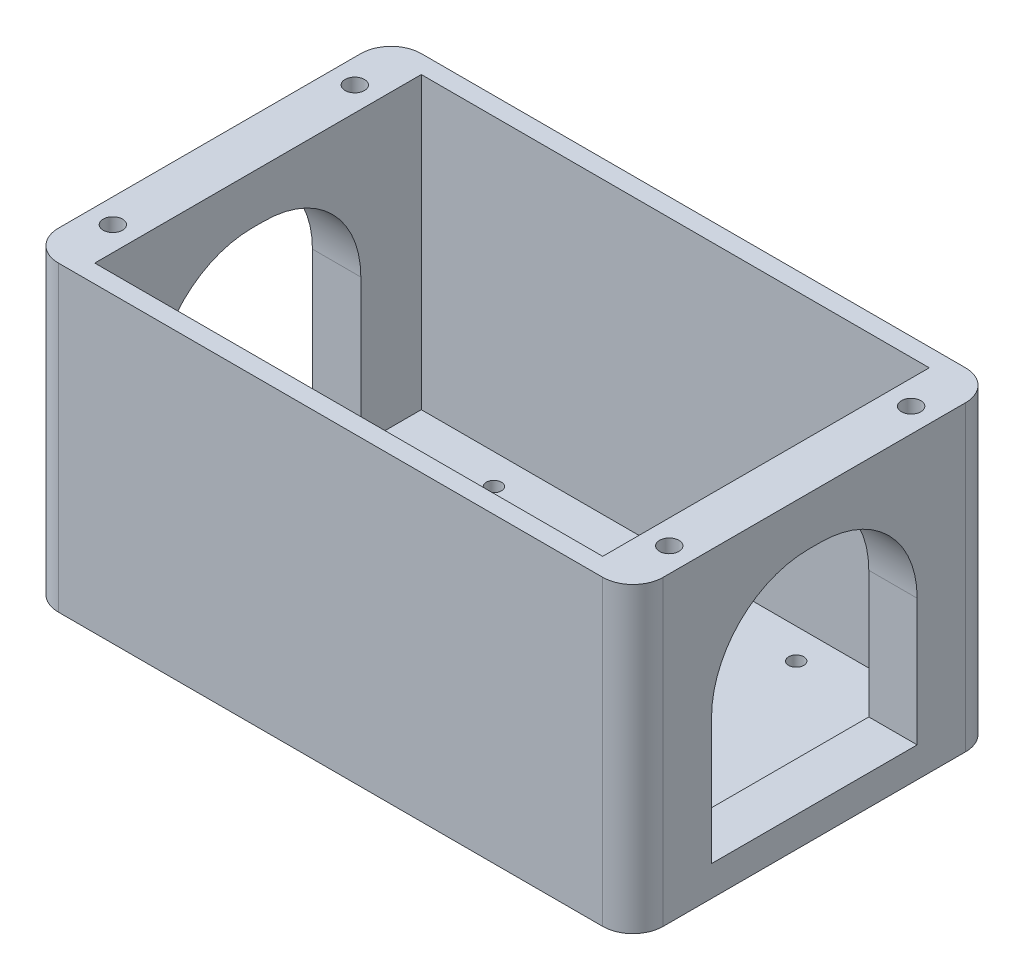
ISO-10303-21;
HEADER;
FILE_DESCRIPTION(('STEP AP214'),'2;1');
FILE_NAME('part.step','',(''),(''),'','','');
FILE_SCHEMA(('AUTOMOTIVE_DESIGN { 1 0 10303 214 1 1 1 1 }'));
ENDSEC;
DATA;
#1=APPLICATION_CONTEXT('core data for automotive mechanical design processes');
#2=APPLICATION_PROTOCOL_DEFINITION('international standard','automotive_design',2000,#1);
#3=PRODUCT_CONTEXT('',#1,'mechanical');
#4=PRODUCT('Part','Part','',(#3));
#5=PRODUCT_RELATED_PRODUCT_CATEGORY('part','',(#4));
#6=PRODUCT_DEFINITION_FORMATION('','',#4);
#7=PRODUCT_DEFINITION_CONTEXT('part definition',#1,'design');
#8=PRODUCT_DEFINITION('design','',#6,#7);
#9=PRODUCT_DEFINITION_SHAPE('','',#8);
#10=(LENGTH_UNIT() NAMED_UNIT(*) SI_UNIT(.MILLI.,.METRE.));
#11=(NAMED_UNIT(*) PLANE_ANGLE_UNIT() SI_UNIT($,.RADIAN.));
#12=(NAMED_UNIT(*) SI_UNIT($,.STERADIAN.) SOLID_ANGLE_UNIT());
#13=UNCERTAINTY_MEASURE_WITH_UNIT(LENGTH_MEASURE(1.E-05),#10,'distance_accuracy_value','');
#14=(GEOMETRIC_REPRESENTATION_CONTEXT(3) GLOBAL_UNCERTAINTY_ASSIGNED_CONTEXT((#13)) GLOBAL_UNIT_ASSIGNED_CONTEXT((#10,
#11,#12)) REPRESENTATION_CONTEXT('',''));
#15=CARTESIAN_POINT('',(0.,0.,0.));
#16=DIRECTION('',(0.,0.,1.));
#17=DIRECTION('',(1.,0.,0.));
#18=AXIS2_PLACEMENT_3D('',#15,#16,#17);
#19=CARTESIAN_POINT('',(0.,63.5,0.));
#20=DIRECTION('',(1.,0.,0.));
#21=DIRECTION('',(0.,0.,-1.));
#22=AXIS2_PLACEMENT_3D('',#19,#20,#21);
#23=PLANE('',#22);
#24=DIRECTION('',(0.,0.,1.));
#25=VECTOR('',#24,1.);
#26=CARTESIAN_POINT('',(0.,6.35,-59.69));
#27=LINE('',#26,#25);
#28=CARTESIAN_POINT('',(0.,6.35,-59.69));
#29=VERTEX_POINT('',#28);
#30=CARTESIAN_POINT('',(0.,6.35,-16.51));
#31=VERTEX_POINT('',#30);
#32=EDGE_CURVE('E233',#29,#31,#27,.T.);
#33=ORIENTED_EDGE('',*,*,#32,.F.);
#34=DIRECTION('',(0.,-1.,0.));
#35=VECTOR('',#34,1.);
#36=CARTESIAN_POINT('',(0.,6.35,-59.69));
#37=LINE('',#36,#35);
#38=CARTESIAN_POINT('',(0.,33.0199999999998,-59.69));
#39=VERTEX_POINT('',#38);
#40=EDGE_CURVE('E48',#39,#29,#37,.T.);
#41=ORIENTED_EDGE('',*,*,#40,.F.);
#42=CARTESIAN_POINT('',(0.,33.02,-39.37));
#43=DIRECTION('',(-1.,0.,0.));
#44=DIRECTION('',(0.,0.,-1.));
#45=AXIS2_PLACEMENT_3D('',#42,#43,#44);
#46=CIRCLE('',#45,20.32);
#47=CARTESIAN_POINT('',(0.,53.34,-39.3699999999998));
#48=VERTEX_POINT('',#47);
#49=EDGE_CURVE('E219',#48,#39,#46,.T.);
#50=ORIENTED_EDGE('',*,*,#49,.F.);
#51=DIRECTION('',(0.,0.,-1.));
#52=VECTOR('',#51,1.);
#53=CARTESIAN_POINT('',(0.,53.34,-39.3699999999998));
#54=LINE('',#53,#52);
#55=CARTESIAN_POINT('',(0.,53.34,-36.8300000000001));
#56=VERTEX_POINT('',#55);
#57=EDGE_CURVE('E222',#56,#48,#54,.T.);
#58=ORIENTED_EDGE('',*,*,#57,.F.);
#59=CARTESIAN_POINT('',(0.,33.02,-36.83));
#60=DIRECTION('',(-1.,0.,0.));
#61=DIRECTION('',(0.,0.,-1.));
#62=AXIS2_PLACEMENT_3D('',#59,#60,#61);
#63=CIRCLE('',#62,20.32);
#64=CARTESIAN_POINT('',(0.,33.0199999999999,-16.51));
#65=VERTEX_POINT('',#64);
#66=EDGE_CURVE('E239',#65,#56,#63,.T.);
#67=ORIENTED_EDGE('',*,*,#66,.F.);
#68=DIRECTION('',(0.,1.,0.));
#69=VECTOR('',#68,1.);
#70=CARTESIAN_POINT('',(0.,6.35,-16.51));
#71=LINE('',#70,#69);
#72=EDGE_CURVE('E236',#31,#65,#71,.T.);
#73=ORIENTED_EDGE('',*,*,#72,.F.);
#74=EDGE_LOOP('',(#33,#41,#50,#58,#67,#73));
#75=FACE_BOUND('',#74,.T.);
#76=DIRECTION('',(0.,0.,1.));
#77=VECTOR('',#76,1.);
#78=CARTESIAN_POINT('',(0.,0.,0.));
#79=LINE('',#78,#77);
#80=CARTESIAN_POINT('',(0.,0.,-69.85));
#81=VERTEX_POINT('',#80);
#82=CARTESIAN_POINT('',(0.,0.,-6.35));
#83=VERTEX_POINT('',#82);
#84=EDGE_CURVE('E344',#81,#83,#79,.T.);
#85=ORIENTED_EDGE('',*,*,#84,.T.);
#86=DIRECTION('',(0.,-1.,0.));
#87=VECTOR('',#86,1.);
#88=CARTESIAN_POINT('',(0.,63.5,-6.35));
#89=LINE('',#88,#87);
#90=CARTESIAN_POINT('',(0.,63.5,-6.35));
#91=VERTEX_POINT('',#90);
#92=EDGE_CURVE('E403',#83,#91,#89,.F.);
#93=ORIENTED_EDGE('',*,*,#92,.T.);
#94=DIRECTION('',(0.,0.,1.));
#95=VECTOR('',#94,1.);
#96=CARTESIAN_POINT('',(0.,63.5,0.));
#97=LINE('',#96,#95);
#98=CARTESIAN_POINT('',(0.,63.5,-69.85));
#99=VERTEX_POINT('',#98);
#100=EDGE_CURVE('E351',#99,#91,#97,.T.);
#101=ORIENTED_EDGE('',*,*,#100,.F.);
#102=DIRECTION('',(0.,-1.,0.));
#103=VECTOR('',#102,1.);
#104=CARTESIAN_POINT('',(0.,63.5,-69.85));
#105=LINE('',#104,#103);
#106=EDGE_CURVE('E400',#99,#81,#105,.T.);
#107=ORIENTED_EDGE('',*,*,#106,.T.);
#108=EDGE_LOOP('',(#85,#93,#101,#107));
#109=FACE_BOUND('',#108,.T.);
#110=ADVANCED_FACE('F33',(#75,#109),#23,.F.);
#111=CARTESIAN_POINT('',(0.,63.5,0.));
#112=DIRECTION('',(0.,0.,-1.));
#113=DIRECTION('',(-1.,0.,0.));
#114=AXIS2_PLACEMENT_3D('',#111,#112,#113);
#115=PLANE('',#114);
#116=DIRECTION('',(1.,0.,0.));
#117=VECTOR('',#116,1.);
#118=CARTESIAN_POINT('',(0.,0.,0.));
#119=LINE('',#118,#117);
#120=CARTESIAN_POINT('',(6.35,0.,0.));
#121=VERTEX_POINT('',#120);
#122=CARTESIAN_POINT('',(120.65,0.,0.));
#123=VERTEX_POINT('',#122);
#124=EDGE_CURVE('E367',#121,#123,#119,.T.);
#125=ORIENTED_EDGE('',*,*,#124,.T.);
#126=DIRECTION('',(0.,-1.,0.));
#127=VECTOR('',#126,1.);
#128=CARTESIAN_POINT('',(120.65,63.5,0.));
#129=LINE('',#128,#127);
#130=CARTESIAN_POINT('',(120.65,63.5,0.));
#131=VERTEX_POINT('',#130);
#132=EDGE_CURVE('E390',#123,#131,#129,.F.);
#133=ORIENTED_EDGE('',*,*,#132,.T.);
#134=DIRECTION('',(1.,0.,0.));
#135=VECTOR('',#134,1.);
#136=CARTESIAN_POINT('',(0.,63.5,0.));
#137=LINE('',#136,#135);
#138=CARTESIAN_POINT('',(6.35,63.5,0.));
#139=VERTEX_POINT('',#138);
#140=EDGE_CURVE('E354',#139,#131,#137,.T.);
#141=ORIENTED_EDGE('',*,*,#140,.F.);
#142=DIRECTION('',(0.,-1.,0.));
#143=VECTOR('',#142,1.);
#144=CARTESIAN_POINT('',(6.35,63.5,0.));
#145=LINE('',#144,#143);
#146=EDGE_CURVE('E387',#139,#121,#145,.T.);
#147=ORIENTED_EDGE('',*,*,#146,.T.);
#148=EDGE_LOOP('',(#125,#133,#141,#147));
#149=FACE_BOUND('',#148,.T.);
#150=ADVANCED_FACE('F456',(#149),#115,.F.);
#151=CARTESIAN_POINT('',(127.,63.5,0.));
#152=DIRECTION('',(-1.,0.,0.));
#153=DIRECTION('',(0.,0.,1.));
#154=AXIS2_PLACEMENT_3D('',#151,#152,#153);
#155=PLANE('',#154);
#156=CARTESIAN_POINT('',(127.,33.02,-39.37));
#157=DIRECTION('',(-1.,0.,0.));
#158=DIRECTION('',(0.,0.,-1.));
#159=AXIS2_PLACEMENT_3D('',#156,#157,#158);
#160=CIRCLE('',#159,20.32);
#161=CARTESIAN_POINT('',(127.,53.34,-39.3699999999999));
#162=VERTEX_POINT('',#161);
#163=CARTESIAN_POINT('',(127.,33.0199999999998,-59.69));
#164=VERTEX_POINT('',#163);
#165=EDGE_CURVE('E218',#162,#164,#160,.T.);
#166=ORIENTED_EDGE('',*,*,#165,.T.);
#167=DIRECTION('',(0.,-1.,0.));
#168=VECTOR('',#167,1.);
#169=CARTESIAN_POINT('',(127.,6.35,-59.69));
#170=LINE('',#169,#168);
#171=CARTESIAN_POINT('',(127.,6.35,-59.69));
#172=VERTEX_POINT('',#171);
#173=EDGE_CURVE('E201',#164,#172,#170,.T.);
#174=ORIENTED_EDGE('',*,*,#173,.T.);
#175=DIRECTION('',(0.,0.,1.));
#176=VECTOR('',#175,1.);
#177=CARTESIAN_POINT('',(127.,6.35,-59.69));
#178=LINE('',#177,#176);
#179=CARTESIAN_POINT('',(127.,6.35,-16.51));
#180=VERTEX_POINT('',#179);
#181=EDGE_CURVE('E209',#172,#180,#178,.T.);
#182=ORIENTED_EDGE('',*,*,#181,.T.);
#183=DIRECTION('',(0.,1.,0.));
#184=VECTOR('',#183,1.);
#185=CARTESIAN_POINT('',(127.,6.35,-16.51));
#186=LINE('',#185,#184);
#187=CARTESIAN_POINT('',(127.,33.0199999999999,-16.51));
#188=VERTEX_POINT('',#187);
#189=EDGE_CURVE('E56',#180,#188,#186,.T.);
#190=ORIENTED_EDGE('',*,*,#189,.T.);
#191=CARTESIAN_POINT('',(127.,33.02,-36.83));
#192=DIRECTION('',(-1.,0.,0.));
#193=DIRECTION('',(0.,0.,-1.));
#194=AXIS2_PLACEMENT_3D('',#191,#192,#193);
#195=CIRCLE('',#194,20.32);
#196=CARTESIAN_POINT('',(127.,53.34,-36.8300000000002));
#197=VERTEX_POINT('',#196);
#198=EDGE_CURVE('E226',#188,#197,#195,.T.);
#199=ORIENTED_EDGE('',*,*,#198,.T.);
#200=DIRECTION('',(0.,0.,-1.));
#201=VECTOR('',#200,1.);
#202=CARTESIAN_POINT('',(127.,53.34,-39.3699999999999));
#203=LINE('',#202,#201);
#204=EDGE_CURVE('E229',#197,#162,#203,.T.);
#205=ORIENTED_EDGE('',*,*,#204,.T.);
#206=EDGE_LOOP('',(#166,#174,#182,#190,#199,#205));
#207=FACE_BOUND('',#206,.T.);
#208=DIRECTION('',(0.,0.,-1.));
#209=VECTOR('',#208,1.);
#210=CARTESIAN_POINT('',(127.,63.5,0.));
#211=LINE('',#210,#209);
#212=CARTESIAN_POINT('',(127.,63.5,-6.35));
#213=VERTEX_POINT('',#212);
#214=CARTESIAN_POINT('',(127.,63.5,-69.85));
#215=VERTEX_POINT('',#214);
#216=EDGE_CURVE('E358',#213,#215,#211,.T.);
#217=ORIENTED_EDGE('',*,*,#216,.F.);
#218=DIRECTION('',(0.,-1.,0.));
#219=VECTOR('',#218,1.);
#220=CARTESIAN_POINT('',(127.,63.5,-6.35));
#221=LINE('',#220,#219);
#222=CARTESIAN_POINT('',(127.,0.,-6.35));
#223=VERTEX_POINT('',#222);
#224=EDGE_CURVE('E376',#213,#223,#221,.T.);
#225=ORIENTED_EDGE('',*,*,#224,.T.);
#226=DIRECTION('',(0.,0.,-1.));
#227=VECTOR('',#226,1.);
#228=CARTESIAN_POINT('',(127.,0.,0.));
#229=LINE('',#228,#227);
#230=CARTESIAN_POINT('',(127.,0.,-69.85));
#231=VERTEX_POINT('',#230);
#232=EDGE_CURVE('E370',#223,#231,#229,.T.);
#233=ORIENTED_EDGE('',*,*,#232,.T.);
#234=DIRECTION('',(0.,-1.,0.));
#235=VECTOR('',#234,1.);
#236=CARTESIAN_POINT('',(127.,63.5,-69.85));
#237=LINE('',#236,#235);
#238=EDGE_CURVE('E364',#231,#215,#237,.F.);
#239=ORIENTED_EDGE('',*,*,#238,.T.);
#240=EDGE_LOOP('',(#217,#225,#233,#239));
#241=FACE_BOUND('',#240,.T.);
#242=ADVANCED_FACE('F214',(#207,#241),#155,.F.);
#243=CARTESIAN_POINT('',(0.,63.5,-76.2));
#244=DIRECTION('',(0.,0.,1.));
#245=DIRECTION('',(1.,0.,0.));
#246=AXIS2_PLACEMENT_3D('',#243,#244,#245);
#247=PLANE('',#246);
#248=DIRECTION('',(-1.,0.,0.));
#249=VECTOR('',#248,1.);
#250=CARTESIAN_POINT('',(0.,63.5,-76.2));
#251=LINE('',#250,#249);
#252=CARTESIAN_POINT('',(120.65,63.5,-76.2));
#253=VERTEX_POINT('',#252);
#254=CARTESIAN_POINT('',(6.34999999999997,63.5,-76.2));
#255=VERTEX_POINT('',#254);
#256=EDGE_CURVE('E361',#253,#255,#251,.T.);
#257=ORIENTED_EDGE('',*,*,#256,.F.);
#258=DIRECTION('',(0.,-1.,0.));
#259=VECTOR('',#258,1.);
#260=CARTESIAN_POINT('',(120.65,63.5,-76.2));
#261=LINE('',#260,#259);
#262=CARTESIAN_POINT('',(120.65,0.,-76.2));
#263=VERTEX_POINT('',#262);
#264=EDGE_CURVE('E407',#253,#263,#261,.T.);
#265=ORIENTED_EDGE('',*,*,#264,.T.);
#266=DIRECTION('',(-1.,0.,0.));
#267=VECTOR('',#266,1.);
#268=CARTESIAN_POINT('',(0.,0.,-76.2));
#269=LINE('',#268,#267);
#270=CARTESIAN_POINT('',(6.34999999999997,0.,-76.2));
#271=VERTEX_POINT('',#270);
#272=EDGE_CURVE('E355',#263,#271,#269,.T.);
#273=ORIENTED_EDGE('',*,*,#272,.T.);
#274=DIRECTION('',(0.,-1.,0.));
#275=VECTOR('',#274,1.);
#276=CARTESIAN_POINT('',(6.34999999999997,63.5,-76.2));
#277=LINE('',#276,#275);
#278=EDGE_CURVE('E405',#271,#255,#277,.F.);
#279=ORIENTED_EDGE('',*,*,#278,.T.);
#280=EDGE_LOOP('',(#257,#265,#273,#279));
#281=FACE_BOUND('',#280,.T.);
#282=ADVANCED_FACE('F495',(#281),#247,.F.);
#283=CARTESIAN_POINT('',(0.,63.5,0.));
#284=DIRECTION('',(0.,-1.,0.));
#285=DIRECTION('',(0.,0.,-1.));
#286=AXIS2_PLACEMENT_3D('',#283,#284,#285);
#287=PLANE('',#286);
#288=CARTESIAN_POINT('',(121.92,63.5,-12.7));
#289=DIRECTION('',(0.,1.,0.));
#290=DIRECTION('',(0.,0.,1.));
#291=AXIS2_PLACEMENT_3D('',#288,#289,#290);
#292=CIRCLE('',#291,2.03200000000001);
#293=CARTESIAN_POINT('',(121.92,63.5,-10.668));
#294=VERTEX_POINT('',#293);
#295=EDGE_CURVE('E298',#294,#294,#292,.T.);
#296=ORIENTED_EDGE('',*,*,#295,.F.);
#297=EDGE_LOOP('',(#296));
#298=FACE_BOUND('',#297,.T.);
#299=CARTESIAN_POINT('',(121.92,63.5,-63.5));
#300=DIRECTION('',(0.,1.,0.));
#301=DIRECTION('',(0.,0.,1.));
#302=AXIS2_PLACEMENT_3D('',#299,#300,#301);
#303=CIRCLE('',#302,2.03200000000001);
#304=CARTESIAN_POINT('',(121.92,63.5,-61.468));
#305=VERTEX_POINT('',#304);
#306=EDGE_CURVE('E297',#305,#305,#303,.T.);
#307=ORIENTED_EDGE('',*,*,#306,.F.);
#308=EDGE_LOOP('',(#307));
#309=FACE_BOUND('',#308,.T.);
#310=CARTESIAN_POINT('',(5.07999999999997,63.5,-12.7));
#311=DIRECTION('',(0.,1.,0.));
#312=DIRECTION('',(0.,0.,1.));
#313=AXIS2_PLACEMENT_3D('',#310,#311,#312);
#314=CIRCLE('',#313,2.032);
#315=CARTESIAN_POINT('',(5.07999999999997,63.5,-10.668));
#316=VERTEX_POINT('',#315);
#317=EDGE_CURVE('E304',#316,#316,#314,.T.);
#318=ORIENTED_EDGE('',*,*,#317,.F.);
#319=EDGE_LOOP('',(#318));
#320=FACE_BOUND('',#319,.T.);
#321=CARTESIAN_POINT('',(5.07999999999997,63.5,-63.5));
#322=DIRECTION('',(0.,1.,0.));
#323=DIRECTION('',(0.,0.,1.));
#324=AXIS2_PLACEMENT_3D('',#321,#322,#323);
#325=CIRCLE('',#324,2.032);
#326=CARTESIAN_POINT('',(5.07999999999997,63.5,-61.468));
#327=VERTEX_POINT('',#326);
#328=EDGE_CURVE('E310',#327,#327,#325,.T.);
#329=ORIENTED_EDGE('',*,*,#328,.F.);
#330=EDGE_LOOP('',(#329));
#331=FACE_BOUND('',#330,.T.);
#332=DIRECTION('',(1.,0.,0.));
#333=VECTOR('',#332,1.);
#334=CARTESIAN_POINT('',(10.16,63.5,-3.81000000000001));
#335=LINE('',#334,#333);
#336=CARTESIAN_POINT('',(10.16,63.5,-3.81000000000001));
#337=VERTEX_POINT('',#336);
#338=CARTESIAN_POINT('',(116.84,63.5,-3.81000000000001));
#339=VERTEX_POINT('',#338);
#340=EDGE_CURVE('E334',#337,#339,#335,.T.);
#341=ORIENTED_EDGE('',*,*,#340,.F.);
#342=DIRECTION('',(0.,0.,1.));
#343=VECTOR('',#342,1.);
#344=CARTESIAN_POINT('',(10.16,63.5,-3.81000000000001));
#345=LINE('',#344,#343);
#346=CARTESIAN_POINT('',(10.16,63.5,-72.39));
#347=VERTEX_POINT('',#346);
#348=EDGE_CURVE('E316',#347,#337,#345,.T.);
#349=ORIENTED_EDGE('',*,*,#348,.F.);
#350=DIRECTION('',(-1.,0.,0.));
#351=VECTOR('',#350,1.);
#352=CARTESIAN_POINT('',(10.16,63.5,-72.39));
#353=LINE('',#352,#351);
#354=CARTESIAN_POINT('',(116.84,63.5,-72.39));
#355=VERTEX_POINT('',#354);
#356=EDGE_CURVE('E323',#355,#347,#353,.T.);
#357=ORIENTED_EDGE('',*,*,#356,.F.);
#358=DIRECTION('',(0.,0.,-1.));
#359=VECTOR('',#358,1.);
#360=CARTESIAN_POINT('',(116.84,63.5,-3.81000000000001));
#361=LINE('',#360,#359);
#362=EDGE_CURVE('E337',#339,#355,#361,.T.);
#363=ORIENTED_EDGE('',*,*,#362,.F.);
#364=EDGE_LOOP('',(#341,#349,#357,#363));
#365=FACE_BOUND('',#364,.T.);
#366=ORIENTED_EDGE('',*,*,#140,.T.);
#367=CARTESIAN_POINT('',(120.65,63.5,-6.35));
#368=DIRECTION('',(0.,-1.,0.));
#369=DIRECTION('',(0.,0.,-1.));
#370=AXIS2_PLACEMENT_3D('',#367,#368,#369);
#371=CIRCLE('',#370,6.35);
#372=EDGE_CURVE('E398',#131,#213,#371,.F.);
#373=ORIENTED_EDGE('',*,*,#372,.T.);
#374=ORIENTED_EDGE('',*,*,#216,.T.);
#375=CARTESIAN_POINT('',(120.65,63.5,-69.85));
#376=DIRECTION('',(0.,-1.,0.));
#377=DIRECTION('',(0.,0.,-1.));
#378=AXIS2_PLACEMENT_3D('',#375,#376,#377);
#379=CIRCLE('',#378,6.35);
#380=EDGE_CURVE('E394',#215,#253,#379,.F.);
#381=ORIENTED_EDGE('',*,*,#380,.T.);
#382=ORIENTED_EDGE('',*,*,#256,.T.);
#383=CARTESIAN_POINT('',(6.34999999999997,63.5,-69.85));
#384=DIRECTION('',(0.,-1.,0.));
#385=DIRECTION('',(0.,0.,-1.));
#386=AXIS2_PLACEMENT_3D('',#383,#384,#385);
#387=CIRCLE('',#386,6.35);
#388=EDGE_CURVE('E392',#255,#99,#387,.F.);
#389=ORIENTED_EDGE('',*,*,#388,.T.);
#390=ORIENTED_EDGE('',*,*,#100,.T.);
#391=CARTESIAN_POINT('',(6.35,63.5,-6.35));
#392=DIRECTION('',(0.,-1.,0.));
#393=DIRECTION('',(0.,0.,-1.));
#394=AXIS2_PLACEMENT_3D('',#391,#392,#393);
#395=CIRCLE('',#394,6.35);
#396=EDGE_CURVE('E396',#91,#139,#395,.F.);
#397=ORIENTED_EDGE('',*,*,#396,.T.);
#398=EDGE_LOOP('',(#366,#373,#374,#381,#382,#389,#390,#397));
#399=FACE_BOUND('',#398,.T.);
#400=ADVANCED_FACE('F491',(#298,#309,#320,#331,#365,#399),#287,.F.);
#401=CARTESIAN_POINT('',(0.,0.,0.));
#402=DIRECTION('',(0.,-1.,0.));
#403=DIRECTION('',(0.,0.,-1.));
#404=AXIS2_PLACEMENT_3D('',#401,#402,#403);
#405=PLANE('',#404);
#406=CARTESIAN_POINT('',(95.25,0.,-66.04));
#407=DIRECTION('',(0.,-1.,0.));
#408=DIRECTION('',(0.,0.,1.));
#409=AXIS2_PLACEMENT_3D('',#406,#407,#408);
#410=CIRCLE('',#409,1.5875);
#411=CARTESIAN_POINT('',(95.25,0.,-64.4525));
#412=VERTEX_POINT('',#411);
#413=EDGE_CURVE('E278',#412,#412,#410,.T.);
#414=ORIENTED_EDGE('',*,*,#413,.F.);
#415=EDGE_LOOP('',(#414));
#416=FACE_BOUND('',#415,.T.);
#417=CARTESIAN_POINT('',(95.25,0.,-10.16));
#418=DIRECTION('',(0.,-1.,0.));
#419=DIRECTION('',(0.,0.,-1.));
#420=AXIS2_PLACEMENT_3D('',#417,#418,#419);
#421=CIRCLE('',#420,1.5875);
#422=CARTESIAN_POINT('',(95.25,0.,-11.7475));
#423=VERTEX_POINT('',#422);
#424=EDGE_CURVE('E282',#423,#423,#421,.T.);
#425=ORIENTED_EDGE('',*,*,#424,.F.);
#426=EDGE_LOOP('',(#425));
#427=FACE_BOUND('',#426,.T.);
#428=CARTESIAN_POINT('',(31.75,0.,-10.16));
#429=DIRECTION('',(0.,-1.,0.));
#430=DIRECTION('',(0.,0.,1.));
#431=AXIS2_PLACEMENT_3D('',#428,#429,#430);
#432=CIRCLE('',#431,1.5875);
#433=CARTESIAN_POINT('',(31.75,0.,-8.57249999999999));
#434=VERTEX_POINT('',#433);
#435=EDGE_CURVE('E286',#434,#434,#432,.T.);
#436=ORIENTED_EDGE('',*,*,#435,.F.);
#437=EDGE_LOOP('',(#436));
#438=FACE_BOUND('',#437,.T.);
#439=CARTESIAN_POINT('',(31.75,0.,-66.04));
#440=DIRECTION('',(0.,-1.,0.));
#441=DIRECTION('',(0.,0.,-1.));
#442=AXIS2_PLACEMENT_3D('',#439,#440,#441);
#443=CIRCLE('',#442,1.5875);
#444=CARTESIAN_POINT('',(31.75,0.,-67.6275));
#445=VERTEX_POINT('',#444);
#446=EDGE_CURVE('E290',#445,#445,#443,.T.);
#447=ORIENTED_EDGE('',*,*,#446,.F.);
#448=EDGE_LOOP('',(#447));
#449=FACE_BOUND('',#448,.T.);
#450=CARTESIAN_POINT('',(121.92,0.,-12.7));
#451=DIRECTION('',(0.,1.,0.));
#452=DIRECTION('',(0.,0.,1.));
#453=AXIS2_PLACEMENT_3D('',#450,#451,#452);
#454=CIRCLE('',#453,2.03200000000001);
#455=CARTESIAN_POINT('',(121.92,0.,-10.668));
#456=VERTEX_POINT('',#455);
#457=EDGE_CURVE('E294',#456,#456,#454,.T.);
#458=ORIENTED_EDGE('',*,*,#457,.T.);
#459=EDGE_LOOP('',(#458));
#460=FACE_BOUND('',#459,.T.);
#461=CARTESIAN_POINT('',(121.92,0.,-63.5));
#462=DIRECTION('',(0.,1.,0.));
#463=DIRECTION('',(0.,0.,1.));
#464=AXIS2_PLACEMENT_3D('',#461,#462,#463);
#465=CIRCLE('',#464,2.03200000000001);
#466=CARTESIAN_POINT('',(121.92,0.,-61.468));
#467=VERTEX_POINT('',#466);
#468=EDGE_CURVE('E301',#467,#467,#465,.T.);
#469=ORIENTED_EDGE('',*,*,#468,.T.);
#470=EDGE_LOOP('',(#469));
#471=FACE_BOUND('',#470,.T.);
#472=CARTESIAN_POINT('',(5.07999999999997,0.,-12.7));
#473=DIRECTION('',(0.,1.,0.));
#474=DIRECTION('',(0.,0.,1.));
#475=AXIS2_PLACEMENT_3D('',#472,#473,#474);
#476=CIRCLE('',#475,2.032);
#477=CARTESIAN_POINT('',(5.07999999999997,0.,-10.668));
#478=VERTEX_POINT('',#477);
#479=EDGE_CURVE('E307',#478,#478,#476,.T.);
#480=ORIENTED_EDGE('',*,*,#479,.T.);
#481=EDGE_LOOP('',(#480));
#482=FACE_BOUND('',#481,.T.);
#483=CARTESIAN_POINT('',(5.07999999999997,0.,-63.5));
#484=DIRECTION('',(0.,1.,0.));
#485=DIRECTION('',(0.,0.,1.));
#486=AXIS2_PLACEMENT_3D('',#483,#484,#485);
#487=CIRCLE('',#486,2.032);
#488=CARTESIAN_POINT('',(5.07999999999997,0.,-61.468));
#489=VERTEX_POINT('',#488);
#490=EDGE_CURVE('E313',#489,#489,#487,.T.);
#491=ORIENTED_EDGE('',*,*,#490,.T.);
#492=EDGE_LOOP('',(#491));
#493=FACE_BOUND('',#492,.T.);
#494=ORIENTED_EDGE('',*,*,#232,.F.);
#495=CARTESIAN_POINT('',(120.65,0.,-6.35));
#496=DIRECTION('',(0.,-1.,0.));
#497=DIRECTION('',(0.,0.,-1.));
#498=AXIS2_PLACEMENT_3D('',#495,#496,#497);
#499=CIRCLE('',#498,6.35);
#500=EDGE_CURVE('E385',#223,#123,#499,.T.);
#501=ORIENTED_EDGE('',*,*,#500,.T.);
#502=ORIENTED_EDGE('',*,*,#124,.F.);
#503=CARTESIAN_POINT('',(6.35,0.,-6.35));
#504=DIRECTION('',(0.,-1.,0.));
#505=DIRECTION('',(0.,0.,-1.));
#506=AXIS2_PLACEMENT_3D('',#503,#504,#505);
#507=CIRCLE('',#506,6.35);
#508=EDGE_CURVE('E383',#121,#83,#507,.T.);
#509=ORIENTED_EDGE('',*,*,#508,.T.);
#510=ORIENTED_EDGE('',*,*,#84,.F.);
#511=CARTESIAN_POINT('',(6.34999999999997,0.,-69.85));
#512=DIRECTION('',(0.,-1.,0.));
#513=DIRECTION('',(0.,0.,-1.));
#514=AXIS2_PLACEMENT_3D('',#511,#512,#513);
#515=CIRCLE('',#514,6.35);
#516=EDGE_CURVE('E379',#81,#271,#515,.T.);
#517=ORIENTED_EDGE('',*,*,#516,.T.);
#518=ORIENTED_EDGE('',*,*,#272,.F.);
#519=CARTESIAN_POINT('',(120.65,0.,-69.85));
#520=DIRECTION('',(0.,-1.,0.));
#521=DIRECTION('',(0.,0.,-1.));
#522=AXIS2_PLACEMENT_3D('',#519,#520,#521);
#523=CIRCLE('',#522,6.35);
#524=EDGE_CURVE('E381',#263,#231,#523,.T.);
#525=ORIENTED_EDGE('',*,*,#524,.T.);
#526=EDGE_LOOP('',(#494,#501,#502,#509,#510,#517,#518,#525));
#527=FACE_BOUND('',#526,.T.);
#528=ADVANCED_FACE('F511',(#416,#427,#438,#449,#460,#471,#482,#493,#527),#405,.T.);
#529=CARTESIAN_POINT('',(10.16,2.54000000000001,-3.81000000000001));
#530=DIRECTION('',(-1.,0.,0.));
#531=DIRECTION('',(0.,0.,1.));
#532=AXIS2_PLACEMENT_3D('',#529,#530,#531);
#533=PLANE('',#532);
#534=CARTESIAN_POINT('',(10.16,33.02,-39.37));
#535=DIRECTION('',(-1.,0.,0.));
#536=DIRECTION('',(0.,0.,1.));
#537=AXIS2_PLACEMENT_3D('',#534,#535,#536);
#538=CIRCLE('',#537,20.32);
#539=CARTESIAN_POINT('',(10.16,53.34,-39.3699999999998));
#540=VERTEX_POINT('',#539);
#541=CARTESIAN_POINT('',(10.16,33.0199999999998,-59.69));
#542=VERTEX_POINT('',#541);
#543=EDGE_CURVE('E272',#540,#542,#538,.T.);
#544=ORIENTED_EDGE('',*,*,#543,.T.);
#545=DIRECTION('',(0.,-1.,0.));
#546=VECTOR('',#545,1.);
#547=CARTESIAN_POINT('',(10.16,2.54000000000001,-59.69));
#548=LINE('',#547,#546);
#549=CARTESIAN_POINT('',(10.16,6.35,-59.69));
#550=VERTEX_POINT('',#549);
#551=EDGE_CURVE('E275',#542,#550,#548,.T.);
#552=ORIENTED_EDGE('',*,*,#551,.T.);
#553=DIRECTION('',(0.,0.,1.));
#554=VECTOR('',#553,1.);
#555=CARTESIAN_POINT('',(10.16,6.35,-3.81000000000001));
#556=LINE('',#555,#554);
#557=CARTESIAN_POINT('',(10.16,6.35,-16.51));
#558=VERTEX_POINT('',#557);
#559=EDGE_CURVE('E246',#550,#558,#556,.T.);
#560=ORIENTED_EDGE('',*,*,#559,.T.);
#561=DIRECTION('',(0.,1.,0.));
#562=VECTOR('',#561,1.);
#563=CARTESIAN_POINT('',(10.16,2.54000000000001,-16.51));
#564=LINE('',#563,#562);
#565=CARTESIAN_POINT('',(10.16,33.0199999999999,-16.51));
#566=VERTEX_POINT('',#565);
#567=EDGE_CURVE('E263',#558,#566,#564,.T.);
#568=ORIENTED_EDGE('',*,*,#567,.T.);
#569=CARTESIAN_POINT('',(10.16,33.02,-36.83));
#570=DIRECTION('',(-1.,0.,0.));
#571=DIRECTION('',(0.,0.,1.));
#572=AXIS2_PLACEMENT_3D('',#569,#570,#571);
#573=CIRCLE('',#572,20.32);
#574=CARTESIAN_POINT('',(10.16,53.34,-36.8300000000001));
#575=VERTEX_POINT('',#574);
#576=EDGE_CURVE('E266',#566,#575,#573,.T.);
#577=ORIENTED_EDGE('',*,*,#576,.T.);
#578=DIRECTION('',(0.,0.,-1.));
#579=VECTOR('',#578,1.);
#580=CARTESIAN_POINT('',(10.16,53.34,-3.81000000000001));
#581=LINE('',#580,#579);
#582=EDGE_CURVE('E269',#575,#540,#581,.T.);
#583=ORIENTED_EDGE('',*,*,#582,.T.);
#584=EDGE_LOOP('',(#544,#552,#560,#568,#577,#583));
#585=FACE_BOUND('',#584,.T.);
#586=ORIENTED_EDGE('',*,*,#348,.T.);
#587=DIRECTION('',(0.,1.,0.));
#588=VECTOR('',#587,1.);
#589=CARTESIAN_POINT('',(10.16,2.54000000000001,-3.81000000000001));
#590=LINE('',#589,#588);
#591=CARTESIAN_POINT('',(10.16,2.54000000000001,-3.81000000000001));
#592=VERTEX_POINT('',#591);
#593=EDGE_CURVE('E332',#592,#337,#590,.T.);
#594=ORIENTED_EDGE('',*,*,#593,.F.);
#595=DIRECTION('',(0.,0.,1.));
#596=VECTOR('',#595,1.);
#597=CARTESIAN_POINT('',(10.16,2.54000000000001,-3.81000000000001));
#598=LINE('',#597,#596);
#599=CARTESIAN_POINT('',(10.16,2.54000000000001,-72.39));
#600=VERTEX_POINT('',#599);
#601=EDGE_CURVE('E319',#600,#592,#598,.T.);
#602=ORIENTED_EDGE('',*,*,#601,.F.);
#603=DIRECTION('',(0.,1.,0.));
#604=VECTOR('',#603,1.);
#605=CARTESIAN_POINT('',(10.16,2.54000000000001,-72.39));
#606=LINE('',#605,#604);
#607=EDGE_CURVE('E342',#600,#347,#606,.T.);
#608=ORIENTED_EDGE('',*,*,#607,.T.);
#609=EDGE_LOOP('',(#586,#594,#602,#608));
#610=FACE_BOUND('',#609,.T.);
#611=ADVANCED_FACE('F513',(#585,#610),#533,.F.);
#612=CARTESIAN_POINT('',(10.16,2.54000000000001,-72.39));
#613=DIRECTION('',(0.,0.,-1.));
#614=DIRECTION('',(-1.,0.,0.));
#615=AXIS2_PLACEMENT_3D('',#612,#613,#614);
#616=PLANE('',#615);
#617=ORIENTED_EDGE('',*,*,#356,.T.);
#618=ORIENTED_EDGE('',*,*,#607,.F.);
#619=DIRECTION('',(-1.,0.,0.));
#620=VECTOR('',#619,1.);
#621=CARTESIAN_POINT('',(10.16,2.54000000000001,-72.39));
#622=LINE('',#621,#620);
#623=CARTESIAN_POINT('',(116.84,2.54000000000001,-72.39));
#624=VERTEX_POINT('',#623);
#625=EDGE_CURVE('E329',#624,#600,#622,.T.);
#626=ORIENTED_EDGE('',*,*,#625,.F.);
#627=DIRECTION('',(0.,1.,0.));
#628=VECTOR('',#627,1.);
#629=CARTESIAN_POINT('',(116.84,2.54000000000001,-72.39));
#630=LINE('',#629,#628);
#631=EDGE_CURVE('E345',#624,#355,#630,.T.);
#632=ORIENTED_EDGE('',*,*,#631,.T.);
#633=EDGE_LOOP('',(#617,#618,#626,#632));
#634=FACE_BOUND('',#633,.T.);
#635=ADVANCED_FACE('F521',(#634),#616,.F.);
#636=CARTESIAN_POINT('',(116.84,2.54000000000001,-3.81000000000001));
#637=DIRECTION('',(1.,0.,0.));
#638=DIRECTION('',(0.,0.,-1.));
#639=AXIS2_PLACEMENT_3D('',#636,#637,#638);
#640=PLANE('',#639);
#641=DIRECTION('',(0.,0.,-1.));
#642=VECTOR('',#641,1.);
#643=CARTESIAN_POINT('',(116.84,6.35,-3.81000000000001));
#644=LINE('',#643,#642);
#645=CARTESIAN_POINT('',(116.84,6.35,-16.51));
#646=VERTEX_POINT('',#645);
#647=CARTESIAN_POINT('',(116.84,6.35,-59.69));
#648=VERTEX_POINT('',#647);
#649=EDGE_CURVE('E410',#646,#648,#644,.T.);
#650=ORIENTED_EDGE('',*,*,#649,.T.);
#651=DIRECTION('',(0.,1.,0.));
#652=VECTOR('',#651,1.);
#653=CARTESIAN_POINT('',(116.84,2.54000000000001,-59.69));
#654=LINE('',#653,#652);
#655=CARTESIAN_POINT('',(116.84,33.0199999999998,-59.69));
#656=VERTEX_POINT('',#655);
#657=EDGE_CURVE('E11',#648,#656,#654,.T.);
#658=ORIENTED_EDGE('',*,*,#657,.T.);
#659=CARTESIAN_POINT('',(116.84,33.02,-39.37));
#660=DIRECTION('',(1.,0.,0.));
#661=DIRECTION('',(0.,0.,-1.));
#662=AXIS2_PLACEMENT_3D('',#659,#660,#661);
#663=CIRCLE('',#662,20.32);
#664=CARTESIAN_POINT('',(116.84,53.34,-39.3699999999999));
#665=VERTEX_POINT('',#664);
#666=EDGE_CURVE('E41',#656,#665,#663,.T.);
#667=ORIENTED_EDGE('',*,*,#666,.T.);
#668=DIRECTION('',(0.,0.,1.));
#669=VECTOR('',#668,1.);
#670=CARTESIAN_POINT('',(116.84,53.34,-3.81000000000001));
#671=LINE('',#670,#669);
#672=CARTESIAN_POINT('',(116.84,53.34,-36.8300000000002));
#673=VERTEX_POINT('',#672);
#674=EDGE_CURVE('E426',#665,#673,#671,.T.);
#675=ORIENTED_EDGE('',*,*,#674,.T.);
#676=CARTESIAN_POINT('',(116.84,33.02,-36.83));
#677=DIRECTION('',(1.,0.,0.));
#678=DIRECTION('',(0.,0.,-1.));
#679=AXIS2_PLACEMENT_3D('',#676,#677,#678);
#680=CIRCLE('',#679,20.32);
#681=CARTESIAN_POINT('',(116.84,33.0199999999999,-16.51));
#682=VERTEX_POINT('',#681);
#683=EDGE_CURVE('E423',#673,#682,#680,.T.);
#684=ORIENTED_EDGE('',*,*,#683,.T.);
#685=DIRECTION('',(0.,-1.,0.));
#686=VECTOR('',#685,1.);
#687=CARTESIAN_POINT('',(116.84,2.54000000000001,-16.51));
#688=LINE('',#687,#686);
#689=EDGE_CURVE('E420',#682,#646,#688,.T.);
#690=ORIENTED_EDGE('',*,*,#689,.T.);
#691=EDGE_LOOP('',(#650,#658,#667,#675,#684,#690));
#692=FACE_BOUND('',#691,.T.);
#693=ORIENTED_EDGE('',*,*,#362,.T.);
#694=ORIENTED_EDGE('',*,*,#631,.F.);
#695=DIRECTION('',(0.,0.,-1.));
#696=VECTOR('',#695,1.);
#697=CARTESIAN_POINT('',(116.84,2.54000000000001,-3.81000000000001));
#698=LINE('',#697,#696);
#699=CARTESIAN_POINT('',(116.84,2.54000000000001,-3.81000000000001));
#700=VERTEX_POINT('',#699);
#701=EDGE_CURVE('E326',#700,#624,#698,.T.);
#702=ORIENTED_EDGE('',*,*,#701,.F.);
#703=DIRECTION('',(0.,1.,0.));
#704=VECTOR('',#703,1.);
#705=CARTESIAN_POINT('',(116.84,2.54000000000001,-3.81000000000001));
#706=LINE('',#705,#704);
#707=EDGE_CURVE('E347',#700,#339,#706,.T.);
#708=ORIENTED_EDGE('',*,*,#707,.T.);
#709=EDGE_LOOP('',(#693,#694,#702,#708));
#710=FACE_BOUND('',#709,.T.);
#711=ADVANCED_FACE('F430',(#692,#710),#640,.F.);
#712=CARTESIAN_POINT('',(10.16,2.54000000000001,-3.81000000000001));
#713=DIRECTION('',(0.,0.,1.));
#714=DIRECTION('',(1.,0.,0.));
#715=AXIS2_PLACEMENT_3D('',#712,#713,#714);
#716=PLANE('',#715);
#717=ORIENTED_EDGE('',*,*,#340,.T.);
#718=ORIENTED_EDGE('',*,*,#707,.F.);
#719=DIRECTION('',(1.,0.,0.));
#720=VECTOR('',#719,1.);
#721=CARTESIAN_POINT('',(10.16,2.54000000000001,-3.81000000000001));
#722=LINE('',#721,#720);
#723=EDGE_CURVE('E322',#592,#700,#722,.T.);
#724=ORIENTED_EDGE('',*,*,#723,.F.);
#725=ORIENTED_EDGE('',*,*,#593,.T.);
#726=EDGE_LOOP('',(#717,#718,#724,#725));
#727=FACE_BOUND('',#726,.T.);
#728=ADVANCED_FACE('F542',(#727),#716,.F.);
#729=CARTESIAN_POINT('',(0.,2.54000000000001,0.));
#730=DIRECTION('',(0.,-1.,0.));
#731=DIRECTION('',(0.,0.,-1.));
#732=AXIS2_PLACEMENT_3D('',#729,#730,#731);
#733=PLANE('',#732);
#734=CARTESIAN_POINT('',(95.25,2.54000000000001,-66.04));
#735=DIRECTION('',(0.,-1.,0.));
#736=DIRECTION('',(0.,0.,-1.));
#737=AXIS2_PLACEMENT_3D('',#734,#735,#736);
#738=CIRCLE('',#737,1.5875);
#739=CARTESIAN_POINT('',(95.25,2.54000000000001,-67.6275));
#740=VERTEX_POINT('',#739);
#741=EDGE_CURVE('E281',#740,#740,#738,.T.);
#742=ORIENTED_EDGE('',*,*,#741,.T.);
#743=EDGE_LOOP('',(#742));
#744=FACE_BOUND('',#743,.T.);
#745=CARTESIAN_POINT('',(95.25,2.54000000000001,-10.16));
#746=DIRECTION('',(0.,-1.,0.));
#747=DIRECTION('',(0.,0.,-1.));
#748=AXIS2_PLACEMENT_3D('',#745,#746,#747);
#749=CIRCLE('',#748,1.5875);
#750=CARTESIAN_POINT('',(95.25,2.54000000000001,-11.7475));
#751=VERTEX_POINT('',#750);
#752=EDGE_CURVE('E285',#751,#751,#749,.T.);
#753=ORIENTED_EDGE('',*,*,#752,.T.);
#754=EDGE_LOOP('',(#753));
#755=FACE_BOUND('',#754,.T.);
#756=CARTESIAN_POINT('',(31.75,2.54000000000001,-10.16));
#757=DIRECTION('',(0.,-1.,0.));
#758=DIRECTION('',(0.,0.,-1.));
#759=AXIS2_PLACEMENT_3D('',#756,#757,#758);
#760=CIRCLE('',#759,1.5875);
#761=CARTESIAN_POINT('',(31.75,2.54000000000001,-11.7475));
#762=VERTEX_POINT('',#761);
#763=EDGE_CURVE('E289',#762,#762,#760,.T.);
#764=ORIENTED_EDGE('',*,*,#763,.T.);
#765=EDGE_LOOP('',(#764));
#766=FACE_BOUND('',#765,.T.);
#767=CARTESIAN_POINT('',(31.75,2.54000000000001,-66.04));
#768=DIRECTION('',(0.,-1.,0.));
#769=DIRECTION('',(0.,0.,-1.));
#770=AXIS2_PLACEMENT_3D('',#767,#768,#769);
#771=CIRCLE('',#770,1.5875);
#772=CARTESIAN_POINT('',(31.75,2.54000000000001,-67.6275));
#773=VERTEX_POINT('',#772);
#774=EDGE_CURVE('E293',#773,#773,#771,.T.);
#775=ORIENTED_EDGE('',*,*,#774,.T.);
#776=EDGE_LOOP('',(#775));
#777=FACE_BOUND('',#776,.T.);
#778=ORIENTED_EDGE('',*,*,#601,.T.);
#779=ORIENTED_EDGE('',*,*,#723,.T.);
#780=ORIENTED_EDGE('',*,*,#701,.T.);
#781=ORIENTED_EDGE('',*,*,#625,.T.);
#782=EDGE_LOOP('',(#778,#779,#780,#781));
#783=FACE_BOUND('',#782,.T.);
#784=ADVANCED_FACE('F664',(#744,#755,#766,#777,#783),#733,.F.);
#785=CARTESIAN_POINT('',(5.07999999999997,0.,-63.5));
#786=DIRECTION('',(0.,1.,0.));
#787=DIRECTION('',(0.,0.,1.));
#788=AXIS2_PLACEMENT_3D('',#785,#786,#787);
#789=CYLINDRICAL_SURFACE('',#788,2.032);
#790=ORIENTED_EDGE('',*,*,#490,.F.);
#791=EDGE_LOOP('',(#790));
#792=FACE_BOUND('',#791,.T.);
#793=ORIENTED_EDGE('',*,*,#328,.T.);
#794=EDGE_LOOP('',(#793));
#795=FACE_BOUND('',#794,.T.);
#796=ADVANCED_FACE('F660',(#792,#795),#789,.F.);
#797=CARTESIAN_POINT('',(5.07999999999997,0.,-12.7));
#798=DIRECTION('',(0.,1.,0.));
#799=DIRECTION('',(0.,0.,1.));
#800=AXIS2_PLACEMENT_3D('',#797,#798,#799);
#801=CYLINDRICAL_SURFACE('',#800,2.032);
#802=ORIENTED_EDGE('',*,*,#479,.F.);
#803=EDGE_LOOP('',(#802));
#804=FACE_BOUND('',#803,.T.);
#805=ORIENTED_EDGE('',*,*,#317,.T.);
#806=EDGE_LOOP('',(#805));
#807=FACE_BOUND('',#806,.T.);
#808=ADVANCED_FACE('F656',(#804,#807),#801,.F.);
#809=CARTESIAN_POINT('',(121.92,0.,-63.5));
#810=DIRECTION('',(0.,1.,0.));
#811=DIRECTION('',(0.,0.,1.));
#812=AXIS2_PLACEMENT_3D('',#809,#810,#811);
#813=CYLINDRICAL_SURFACE('',#812,2.03200000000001);
#814=ORIENTED_EDGE('',*,*,#468,.F.);
#815=EDGE_LOOP('',(#814));
#816=FACE_BOUND('',#815,.T.);
#817=ORIENTED_EDGE('',*,*,#306,.T.);
#818=EDGE_LOOP('',(#817));
#819=FACE_BOUND('',#818,.T.);
#820=ADVANCED_FACE('F652',(#816,#819),#813,.F.);
#821=CARTESIAN_POINT('',(121.92,0.,-12.7));
#822=DIRECTION('',(0.,1.,0.));
#823=DIRECTION('',(0.,0.,1.));
#824=AXIS2_PLACEMENT_3D('',#821,#822,#823);
#825=CYLINDRICAL_SURFACE('',#824,2.03200000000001);
#826=ORIENTED_EDGE('',*,*,#457,.F.);
#827=EDGE_LOOP('',(#826));
#828=FACE_BOUND('',#827,.T.);
#829=ORIENTED_EDGE('',*,*,#295,.T.);
#830=EDGE_LOOP('',(#829));
#831=FACE_BOUND('',#830,.T.);
#832=ADVANCED_FACE('F474',(#828,#831),#825,.F.);
#833=CARTESIAN_POINT('',(120.65,63.5,-6.35));
#834=DIRECTION('',(0.,-1.,0.));
#835=DIRECTION('',(0.,0.,-1.));
#836=AXIS2_PLACEMENT_3D('',#833,#834,#835);
#837=CYLINDRICAL_SURFACE('',#836,6.35);
#838=ORIENTED_EDGE('',*,*,#372,.F.);
#839=ORIENTED_EDGE('',*,*,#132,.F.);
#840=ORIENTED_EDGE('',*,*,#500,.F.);
#841=ORIENTED_EDGE('',*,*,#224,.F.);
#842=EDGE_LOOP('',(#838,#839,#840,#841));
#843=FACE_BOUND('',#842,.T.);
#844=ADVANCED_FACE('F470',(#843),#837,.T.);
#845=CARTESIAN_POINT('',(6.35,63.5,-6.35));
#846=DIRECTION('',(0.,-1.,0.));
#847=DIRECTION('',(0.,0.,-1.));
#848=AXIS2_PLACEMENT_3D('',#845,#846,#847);
#849=CYLINDRICAL_SURFACE('',#848,6.35);
#850=ORIENTED_EDGE('',*,*,#396,.F.);
#851=ORIENTED_EDGE('',*,*,#92,.F.);
#852=ORIENTED_EDGE('',*,*,#508,.F.);
#853=ORIENTED_EDGE('',*,*,#146,.F.);
#854=EDGE_LOOP('',(#850,#851,#852,#853));
#855=FACE_BOUND('',#854,.T.);
#856=ADVANCED_FACE('F473',(#855),#849,.T.);
#857=CARTESIAN_POINT('',(120.65,63.5,-69.85));
#858=DIRECTION('',(0.,-1.,0.));
#859=DIRECTION('',(0.,0.,-1.));
#860=AXIS2_PLACEMENT_3D('',#857,#858,#859);
#861=CYLINDRICAL_SURFACE('',#860,6.35);
#862=ORIENTED_EDGE('',*,*,#380,.F.);
#863=ORIENTED_EDGE('',*,*,#238,.F.);
#864=ORIENTED_EDGE('',*,*,#524,.F.);
#865=ORIENTED_EDGE('',*,*,#264,.F.);
#866=EDGE_LOOP('',(#862,#863,#864,#865));
#867=FACE_BOUND('',#866,.T.);
#868=ADVANCED_FACE('F477',(#867),#861,.T.);
#869=CARTESIAN_POINT('',(6.34999999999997,63.5,-69.85));
#870=DIRECTION('',(0.,-1.,0.));
#871=DIRECTION('',(0.,0.,-1.));
#872=AXIS2_PLACEMENT_3D('',#869,#870,#871);
#873=CYLINDRICAL_SURFACE('',#872,6.35);
#874=ORIENTED_EDGE('',*,*,#388,.F.);
#875=ORIENTED_EDGE('',*,*,#278,.F.);
#876=ORIENTED_EDGE('',*,*,#516,.F.);
#877=ORIENTED_EDGE('',*,*,#106,.F.);
#878=EDGE_LOOP('',(#874,#875,#876,#877));
#879=FACE_BOUND('',#878,.T.);
#880=ADVANCED_FACE('F35',(#879),#873,.T.);
#881=CARTESIAN_POINT('',(31.75,63.5,-66.04));
#882=DIRECTION('',(0.,-1.,0.));
#883=DIRECTION('',(0.,0.,-1.));
#884=AXIS2_PLACEMENT_3D('',#881,#882,#883);
#885=CYLINDRICAL_SURFACE('',#884,1.5875);
#886=ORIENTED_EDGE('',*,*,#446,.T.);
#887=EDGE_LOOP('',(#886));
#888=FACE_BOUND('',#887,.T.);
#889=ORIENTED_EDGE('',*,*,#774,.F.);
#890=EDGE_LOOP('',(#889));
#891=FACE_BOUND('',#890,.T.);
#892=ADVANCED_FACE('F484',(#888,#891),#885,.F.);
#893=CARTESIAN_POINT('',(31.75,63.5,-10.16));
#894=DIRECTION('',(0.,-1.,0.));
#895=DIRECTION('',(0.,0.,-1.));
#896=AXIS2_PLACEMENT_3D('',#893,#894,#895);
#897=CYLINDRICAL_SURFACE('',#896,1.5875);
#898=ORIENTED_EDGE('',*,*,#435,.T.);
#899=EDGE_LOOP('',(#898));
#900=FACE_BOUND('',#899,.T.);
#901=ORIENTED_EDGE('',*,*,#763,.F.);
#902=EDGE_LOOP('',(#901));
#903=FACE_BOUND('',#902,.T.);
#904=ADVANCED_FACE('F642',(#900,#903),#897,.F.);
#905=CARTESIAN_POINT('',(95.25,63.5,-10.16));
#906=DIRECTION('',(0.,-1.,0.));
#907=DIRECTION('',(0.,0.,-1.));
#908=AXIS2_PLACEMENT_3D('',#905,#906,#907);
#909=CYLINDRICAL_SURFACE('',#908,1.5875);
#910=ORIENTED_EDGE('',*,*,#424,.T.);
#911=EDGE_LOOP('',(#910));
#912=FACE_BOUND('',#911,.T.);
#913=ORIENTED_EDGE('',*,*,#752,.F.);
#914=EDGE_LOOP('',(#913));
#915=FACE_BOUND('',#914,.T.);
#916=ADVANCED_FACE('F638',(#912,#915),#909,.F.);
#917=CARTESIAN_POINT('',(95.25,63.5,-66.04));
#918=DIRECTION('',(0.,-1.,0.));
#919=DIRECTION('',(0.,0.,-1.));
#920=AXIS2_PLACEMENT_3D('',#917,#918,#919);
#921=CYLINDRICAL_SURFACE('',#920,1.5875);
#922=ORIENTED_EDGE('',*,*,#413,.T.);
#923=EDGE_LOOP('',(#922));
#924=FACE_BOUND('',#923,.T.);
#925=ORIENTED_EDGE('',*,*,#741,.F.);
#926=EDGE_LOOP('',(#925));
#927=FACE_BOUND('',#926,.T.);
#928=ADVANCED_FACE('F450',(#924,#927),#921,.F.);
#929=CARTESIAN_POINT('',(127.,6.35,-59.69));
#930=DIRECTION('',(0.,-1.,0.));
#931=DIRECTION('',(0.,0.,-1.));
#932=AXIS2_PLACEMENT_3D('',#929,#930,#931);
#933=PLANE('',#932);
#934=DIRECTION('',(-1.,0.,0.));
#935=VECTOR('',#934,1.);
#936=CARTESIAN_POINT('',(127.,6.35,-16.51));
#937=LINE('',#936,#935);
#938=EDGE_CURVE('E211',#180,#646,#937,.T.);
#939=ORIENTED_EDGE('',*,*,#938,.F.);
#940=ORIENTED_EDGE('',*,*,#181,.F.);
#941=DIRECTION('',(-1.,0.,0.));
#942=VECTOR('',#941,1.);
#943=CARTESIAN_POINT('',(127.,6.35,-59.69));
#944=LINE('',#943,#942);
#945=EDGE_CURVE('E196',#172,#648,#944,.T.);
#946=ORIENTED_EDGE('',*,*,#945,.T.);
#947=ORIENTED_EDGE('',*,*,#649,.F.);
#948=EDGE_LOOP('',(#939,#940,#946,#947));
#949=FACE_BOUND('',#948,.T.);
#950=ADVANCED_FACE('F210',(#949),#933,.F.);
#951=CARTESIAN_POINT('',(127.,6.35,-16.51));
#952=DIRECTION('',(0.,0.,1.));
#953=DIRECTION('',(1.,0.,0.));
#954=AXIS2_PLACEMENT_3D('',#951,#952,#953);
#955=PLANE('',#954);
#956=DIRECTION('',(-1.,0.,0.));
#957=VECTOR('',#956,1.);
#958=CARTESIAN_POINT('',(127.,33.0199999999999,-16.51));
#959=LINE('',#958,#957);
#960=EDGE_CURVE('E256',#188,#682,#959,.T.);
#961=ORIENTED_EDGE('',*,*,#960,.F.);
#962=ORIENTED_EDGE('',*,*,#189,.F.);
#963=ORIENTED_EDGE('',*,*,#938,.T.);
#964=ORIENTED_EDGE('',*,*,#689,.F.);
#965=EDGE_LOOP('',(#961,#962,#963,#964));
#966=FACE_BOUND('',#965,.T.);
#967=ADVANCED_FACE('F440',(#966),#955,.F.);
#968=CARTESIAN_POINT('',(127.,33.02,-36.83));
#969=DIRECTION('',(-1.,0.,0.));
#970=DIRECTION('',(0.,0.,1.));
#971=AXIS2_PLACEMENT_3D('',#968,#969,#970);
#972=CYLINDRICAL_SURFACE('',#971,20.32);
#973=DIRECTION('',(-1.,0.,0.));
#974=VECTOR('',#973,1.);
#975=CARTESIAN_POINT('',(127.,53.34,-36.8300000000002));
#976=LINE('',#975,#974);
#977=EDGE_CURVE('E252',#197,#673,#976,.T.);
#978=ORIENTED_EDGE('',*,*,#977,.F.);
#979=ORIENTED_EDGE('',*,*,#198,.F.);
#980=ORIENTED_EDGE('',*,*,#960,.T.);
#981=ORIENTED_EDGE('',*,*,#683,.F.);
#982=EDGE_LOOP('',(#978,#979,#980,#981));
#983=FACE_BOUND('',#982,.T.);
#984=ADVANCED_FACE('F439',(#983),#972,.F.);
#985=CARTESIAN_POINT('',(127.,53.34,-39.3699999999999));
#986=DIRECTION('',(0.,1.,0.));
#987=DIRECTION('',(0.,0.,1.));
#988=AXIS2_PLACEMENT_3D('',#985,#986,#987);
#989=PLANE('',#988);
#990=DIRECTION('',(-1.,0.,0.));
#991=VECTOR('',#990,1.);
#992=CARTESIAN_POINT('',(127.,53.34,-39.3699999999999));
#993=LINE('',#992,#991);
#994=EDGE_CURVE('E248',#162,#665,#993,.T.);
#995=ORIENTED_EDGE('',*,*,#994,.F.);
#996=ORIENTED_EDGE('',*,*,#204,.F.);
#997=ORIENTED_EDGE('',*,*,#977,.T.);
#998=ORIENTED_EDGE('',*,*,#674,.F.);
#999=EDGE_LOOP('',(#995,#996,#997,#998));
#1000=FACE_BOUND('',#999,.T.);
#1001=ADVANCED_FACE('F436',(#1000),#989,.F.);
#1002=CARTESIAN_POINT('',(127.,33.02,-39.37));
#1003=DIRECTION('',(-1.,0.,0.));
#1004=DIRECTION('',(0.,0.,1.));
#1005=AXIS2_PLACEMENT_3D('',#1002,#1003,#1004);
#1006=CYLINDRICAL_SURFACE('',#1005,20.32);
#1007=DIRECTION('',(-1.,0.,0.));
#1008=VECTOR('',#1007,1.);
#1009=CARTESIAN_POINT('',(127.,33.0199999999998,-59.69));
#1010=LINE('',#1009,#1008);
#1011=EDGE_CURVE('E244',#164,#656,#1010,.T.);
#1012=ORIENTED_EDGE('',*,*,#1011,.F.);
#1013=ORIENTED_EDGE('',*,*,#165,.F.);
#1014=ORIENTED_EDGE('',*,*,#994,.T.);
#1015=ORIENTED_EDGE('',*,*,#666,.F.);
#1016=EDGE_LOOP('',(#1012,#1013,#1014,#1015));
#1017=FACE_BOUND('',#1016,.T.);
#1018=ADVANCED_FACE('F433',(#1017),#1006,.F.);
#1019=CARTESIAN_POINT('',(127.,6.35,-59.69));
#1020=DIRECTION('',(0.,0.,-1.));
#1021=DIRECTION('',(-1.,0.,0.));
#1022=AXIS2_PLACEMENT_3D('',#1019,#1020,#1021);
#1023=PLANE('',#1022);
#1024=ORIENTED_EDGE('',*,*,#945,.F.);
#1025=ORIENTED_EDGE('',*,*,#173,.F.);
#1026=ORIENTED_EDGE('',*,*,#1011,.T.);
#1027=ORIENTED_EDGE('',*,*,#657,.F.);
#1028=EDGE_LOOP('',(#1024,#1025,#1026,#1027));
#1029=FACE_BOUND('',#1028,.T.);
#1030=ADVANCED_FACE('F198',(#1029),#1023,.F.);
#1031=EDGE_CURVE('E247',#542,#39,#1010,.T.);
#1032=ORIENTED_EDGE('',*,*,#1031,.T.);
#1033=ORIENTED_EDGE('',*,*,#40,.T.);
#1034=EDGE_CURVE('E206',#550,#29,#944,.T.);
#1035=ORIENTED_EDGE('',*,*,#1034,.F.);
#1036=ORIENTED_EDGE('',*,*,#551,.F.);
#1037=EDGE_LOOP('',(#1032,#1033,#1035,#1036));
#1038=FACE_BOUND('',#1037,.T.);
#1039=ADVANCED_FACE('F587',(#1038),#1023,.F.);
#1040=EDGE_CURVE('E251',#540,#48,#993,.T.);
#1041=ORIENTED_EDGE('',*,*,#1040,.T.);
#1042=ORIENTED_EDGE('',*,*,#49,.T.);
#1043=ORIENTED_EDGE('',*,*,#1031,.F.);
#1044=ORIENTED_EDGE('',*,*,#543,.F.);
#1045=EDGE_LOOP('',(#1041,#1042,#1043,#1044));
#1046=FACE_BOUND('',#1045,.T.);
#1047=ADVANCED_FACE('F579',(#1046),#1006,.F.);
#1048=EDGE_CURVE('E255',#575,#56,#976,.T.);
#1049=ORIENTED_EDGE('',*,*,#1048,.T.);
#1050=ORIENTED_EDGE('',*,*,#57,.T.);
#1051=ORIENTED_EDGE('',*,*,#1040,.F.);
#1052=ORIENTED_EDGE('',*,*,#582,.F.);
#1053=EDGE_LOOP('',(#1049,#1050,#1051,#1052));
#1054=FACE_BOUND('',#1053,.T.);
#1055=ADVANCED_FACE('F570',(#1054),#989,.F.);
#1056=EDGE_CURVE('E259',#566,#65,#959,.T.);
#1057=ORIENTED_EDGE('',*,*,#1056,.T.);
#1058=ORIENTED_EDGE('',*,*,#66,.T.);
#1059=ORIENTED_EDGE('',*,*,#1048,.F.);
#1060=ORIENTED_EDGE('',*,*,#576,.F.);
#1061=EDGE_LOOP('',(#1057,#1058,#1059,#1060));
#1062=FACE_BOUND('',#1061,.T.);
#1063=ADVANCED_FACE('F449',(#1062),#972,.F.);
#1064=EDGE_CURVE('E205',#558,#31,#937,.T.);
#1065=ORIENTED_EDGE('',*,*,#1064,.T.);
#1066=ORIENTED_EDGE('',*,*,#72,.T.);
#1067=ORIENTED_EDGE('',*,*,#1056,.F.);
#1068=ORIENTED_EDGE('',*,*,#567,.F.);
#1069=EDGE_LOOP('',(#1065,#1066,#1067,#1068));
#1070=FACE_BOUND('',#1069,.T.);
#1071=ADVANCED_FACE('F443',(#1070),#955,.F.);
#1072=ORIENTED_EDGE('',*,*,#1034,.T.);
#1073=ORIENTED_EDGE('',*,*,#32,.T.);
#1074=ORIENTED_EDGE('',*,*,#1064,.F.);
#1075=ORIENTED_EDGE('',*,*,#559,.F.);
#1076=EDGE_LOOP('',(#1072,#1073,#1074,#1075));
#1077=FACE_BOUND('',#1076,.T.);
#1078=ADVANCED_FACE('F452',(#1077),#933,.F.);
#1079=CLOSED_SHELL('',(#110,#150,#242,#282,#400,#528,#611,#635,#711,#728,#784,#796,#808,#820,
#832,#844,#856,#868,#880,#892,#904,#916,#928,#950,#967,#984,#1001,#1018,#1030,#1039,#1047,#1055,
#1063,#1071,#1078));
#1080=MANIFOLD_SOLID_BREP('B2',#1079);
#1081=ADVANCED_BREP_SHAPE_REPRESENTATION('',(#18,#1080),#14);
#1082=SHAPE_DEFINITION_REPRESENTATION(#9,#1081);
ENDSEC;
END-ISO-10303-21;
